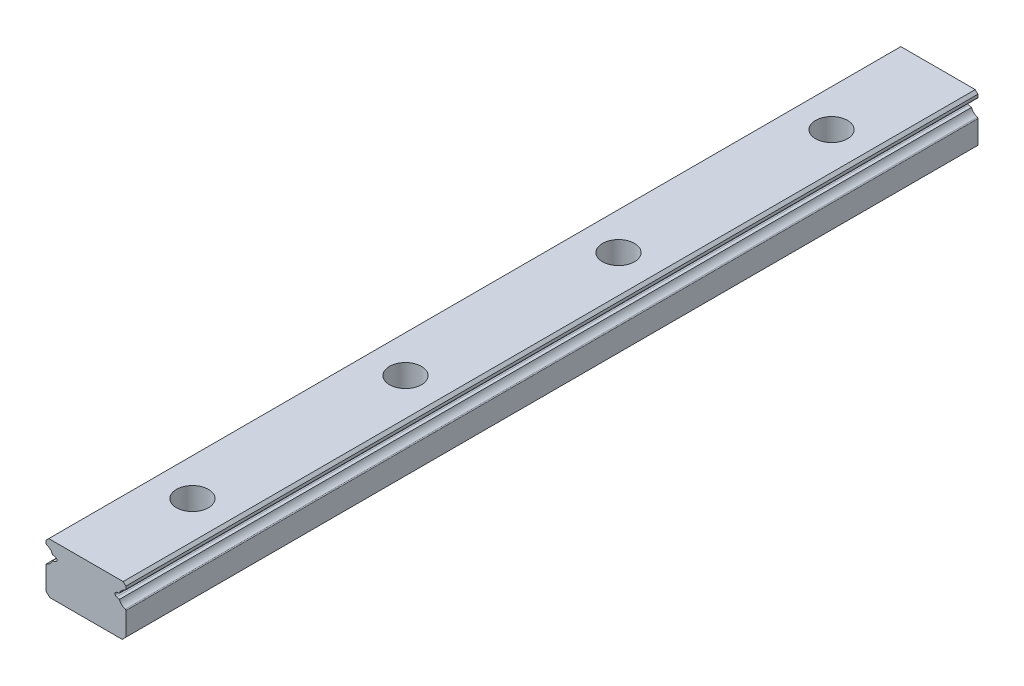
ISO-10303-21;
HEADER;
FILE_DESCRIPTION(('STEP AP214'),'2;1');
FILE_NAME('part.step','',(''),(''),'','','');
FILE_SCHEMA(('AUTOMOTIVE_DESIGN { 1 0 10303 214 1 1 1 1 }'));
ENDSEC;
DATA;
#1=APPLICATION_CONTEXT('core data for automotive mechanical design processes');
#2=APPLICATION_PROTOCOL_DEFINITION('international standard','automotive_design',2000,#1);
#3=PRODUCT_CONTEXT('',#1,'mechanical');
#4=PRODUCT('Part','Part','',(#3));
#5=PRODUCT_RELATED_PRODUCT_CATEGORY('part','',(#4));
#6=PRODUCT_DEFINITION_FORMATION('','',#4);
#7=PRODUCT_DEFINITION_CONTEXT('part definition',#1,'design');
#8=PRODUCT_DEFINITION('design','',#6,#7);
#9=PRODUCT_DEFINITION_SHAPE('','',#8);
#10=(LENGTH_UNIT() NAMED_UNIT(*) SI_UNIT(.MILLI.,.METRE.));
#11=(NAMED_UNIT(*) PLANE_ANGLE_UNIT() SI_UNIT($,.RADIAN.));
#12=(NAMED_UNIT(*) SI_UNIT($,.STERADIAN.) SOLID_ANGLE_UNIT());
#13=UNCERTAINTY_MEASURE_WITH_UNIT(LENGTH_MEASURE(1.E-05),#10,'distance_accuracy_value','');
#14=(GEOMETRIC_REPRESENTATION_CONTEXT(3) GLOBAL_UNCERTAINTY_ASSIGNED_CONTEXT((#13)) GLOBAL_UNIT_ASSIGNED_CONTEXT((#10,
#11,#12)) REPRESENTATION_CONTEXT('',''));
#15=CARTESIAN_POINT('',(0.,0.,0.));
#16=DIRECTION('',(0.,0.,1.));
#17=DIRECTION('',(1.,0.,0.));
#18=AXIS2_PLACEMENT_3D('',#15,#16,#17);
#19=CARTESIAN_POINT('',(-6.27999999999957,-8.749,-160.));
#20=DIRECTION('',(-0.209659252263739,-0.977774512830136,0.));
#21=DIRECTION('',(0.977774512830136,-0.209659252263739,0.));
#22=AXIS2_PLACEMENT_3D('',#19,#20,#21);
#23=PLANE('',#22);
#24=DIRECTION('',(0.977774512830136,-0.209659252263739,0.));
#25=VECTOR('',#24,1.);
#26=CARTESIAN_POINT('',(-6.27999999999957,-8.749,-160.));
#27=LINE('',#26,#25);
#28=CARTESIAN_POINT('',(-6.27999999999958,-8.749,-160.));
#29=VERTEX_POINT('',#28);
#30=CARTESIAN_POINT('',(-5.76751090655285,-8.85889044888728,-160.));
#31=VERTEX_POINT('',#30);
#32=EDGE_CURVE('E211',#29,#31,#27,.T.);
#33=ORIENTED_EDGE('',*,*,#32,.T.);
#34=DIRECTION('',(0.,0.,-1.));
#35=VECTOR('',#34,1.);
#36=CARTESIAN_POINT('',(-5.76751053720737,-8.85889052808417,-160.));
#37=LINE('',#36,#35);
#38=CARTESIAN_POINT('',(-5.76751090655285,-8.85889044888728,0.));
#39=VERTEX_POINT('',#38);
#40=EDGE_CURVE('E182',#31,#39,#37,.F.);
#41=ORIENTED_EDGE('',*,*,#40,.T.);
#42=DIRECTION('',(0.977774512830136,-0.209659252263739,0.));
#43=VECTOR('',#42,1.);
#44=CARTESIAN_POINT('',(-6.27999999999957,-8.749,0.));
#45=LINE('',#44,#43);
#46=CARTESIAN_POINT('',(-6.27999999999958,-8.749,0.));
#47=VERTEX_POINT('',#46);
#48=EDGE_CURVE('E219',#39,#47,#45,.F.);
#49=ORIENTED_EDGE('',*,*,#48,.T.);
#50=DIRECTION('',(0.,0.,-1.));
#51=VECTOR('',#50,1.);
#52=CARTESIAN_POINT('',(-6.27999999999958,-8.749,-160.));
#53=LINE('',#52,#51);
#54=EDGE_CURVE('E214',#47,#29,#53,.T.);
#55=ORIENTED_EDGE('',*,*,#54,.T.);
#56=EDGE_LOOP('',(#33,#41,#49,#55));
#57=FACE_BOUND('',#56,.T.);
#58=ADVANCED_FACE('F16',(#57),#23,.T.);
#59=CARTESIAN_POINT('',(5.7675105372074,-8.85889052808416,-160.));
#60=DIRECTION('',(0.20965925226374,-0.977774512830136,0.));
#61=DIRECTION('',(0.977774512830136,0.20965925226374,0.));
#62=AXIS2_PLACEMENT_3D('',#59,#60,#61);
#63=PLANE('',#62);
#64=DIRECTION('',(0.977774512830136,0.20965925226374,0.));
#65=VECTOR('',#64,1.);
#66=CARTESIAN_POINT('',(5.7675105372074,-8.85889052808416,-160.));
#67=LINE('',#66,#65);
#68=CARTESIAN_POINT('',(5.76751090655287,-8.85889044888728,-160.));
#69=VERTEX_POINT('',#68);
#70=CARTESIAN_POINT('',(6.27999999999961,-8.749,-160.));
#71=VERTEX_POINT('',#70);
#72=EDGE_CURVE('E184',#69,#71,#67,.T.);
#73=ORIENTED_EDGE('',*,*,#72,.T.);
#74=DIRECTION('',(0.,0.,-1.));
#75=VECTOR('',#74,1.);
#76=CARTESIAN_POINT('',(6.27999999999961,-8.749,-160.));
#77=LINE('',#76,#75);
#78=CARTESIAN_POINT('',(6.27999999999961,-8.749,0.));
#79=VERTEX_POINT('',#78);
#80=EDGE_CURVE('E222',#71,#79,#77,.F.);
#81=ORIENTED_EDGE('',*,*,#80,.T.);
#82=DIRECTION('',(0.977774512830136,0.20965925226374,0.));
#83=VECTOR('',#82,1.);
#84=CARTESIAN_POINT('',(5.7675105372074,-8.85889052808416,0.));
#85=LINE('',#84,#83);
#86=CARTESIAN_POINT('',(5.76751090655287,-8.85889044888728,0.));
#87=VERTEX_POINT('',#86);
#88=EDGE_CURVE('E209',#79,#87,#85,.F.);
#89=ORIENTED_EDGE('',*,*,#88,.T.);
#90=DIRECTION('',(0.,0.,-1.));
#91=VECTOR('',#90,1.);
#92=CARTESIAN_POINT('',(5.7675105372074,-8.85889052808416,-160.));
#93=LINE('',#92,#91);
#94=EDGE_CURVE('E204',#87,#69,#93,.T.);
#95=ORIENTED_EDGE('',*,*,#94,.T.);
#96=EDGE_LOOP('',(#73,#81,#89,#95));
#97=FACE_BOUND('',#96,.T.);
#98=ADVANCED_FACE('F834',(#97),#63,.T.);
#99=CARTESIAN_POINT('',(-5.85137497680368,-9.25000017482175,-160.));
#100=DIRECTION('',(0.,0.,-1.));
#101=DIRECTION('',(-1.,0.,0.));
#102=AXIS2_PLACEMENT_3D('',#99,#100,#101);
#103=CYLINDRICAL_SURFACE('',#102,0.4);
#104=ORIENTED_EDGE('',*,*,#40,.F.);
#105=CARTESIAN_POINT('',(-5.85137497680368,-9.25000017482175,-160.));
#106=DIRECTION('',(0.,0.,-1.));
#107=DIRECTION('',(-1.,0.,0.));
#108=AXIS2_PLACEMENT_3D('',#105,#106,#107);
#109=CIRCLE('',#108,0.4);
#110=CARTESIAN_POINT('',(-5.767,-9.641,-160.));
#111=VERTEX_POINT('',#110);
#112=EDGE_CURVE('E19',#111,#31,#109,.F.);
#113=ORIENTED_EDGE('',*,*,#112,.F.);
#114=DIRECTION('',(0.,0.,1.));
#115=VECTOR('',#114,1.);
#116=CARTESIAN_POINT('',(-5.767,-9.641,-160.));
#117=LINE('',#116,#115);
#118=CARTESIAN_POINT('',(-5.767,-9.641,0.));
#119=VERTEX_POINT('',#118);
#120=EDGE_CURVE('E179',#119,#111,#117,.F.);
#121=ORIENTED_EDGE('',*,*,#120,.F.);
#122=CARTESIAN_POINT('',(-5.85137497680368,-9.25000017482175,0.));
#123=DIRECTION('',(0.,0.,-1.));
#124=DIRECTION('',(-1.,0.,0.));
#125=AXIS2_PLACEMENT_3D('',#122,#123,#124);
#126=CIRCLE('',#125,0.4);
#127=EDGE_CURVE('E226',#39,#119,#126,.T.);
#128=ORIENTED_EDGE('',*,*,#127,.F.);
#129=EDGE_LOOP('',(#104,#113,#121,#128));
#130=FACE_BOUND('',#129,.T.);
#131=ADVANCED_FACE('F176',(#130),#103,.F.);
#132=CARTESIAN_POINT('',(7.89004225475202,-9.33975285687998,-160.));
#133=DIRECTION('',(0.,0.,-1.));
#134=DIRECTION('',(-1.,0.,0.));
#135=AXIS2_PLACEMENT_3D('',#132,#133,#134);
#136=CYLINDRICAL_SURFACE('',#135,1.715);
#137=ORIENTED_EDGE('',*,*,#80,.F.);
#138=CARTESIAN_POINT('',(7.89004225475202,-9.33975285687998,-160.));
#139=DIRECTION('',(0.,0.,-1.));
#140=DIRECTION('',(-1.,0.,0.));
#141=AXIS2_PLACEMENT_3D('',#138,#139,#140);
#142=CIRCLE('',#141,1.715);
#143=CARTESIAN_POINT('',(7.35000000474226,-7.71199999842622,-160.));
#144=VERTEX_POINT('',#143);
#145=EDGE_CURVE('E225',#144,#71,#142,.F.);
#146=ORIENTED_EDGE('',*,*,#145,.F.);
#147=DIRECTION('',(0.,0.,-1.));
#148=VECTOR('',#147,1.);
#149=CARTESIAN_POINT('',(7.35000000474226,-7.71199999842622,-160.));
#150=LINE('',#149,#148);
#151=CARTESIAN_POINT('',(7.35000000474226,-7.71199999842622,0.));
#152=VERTEX_POINT('',#151);
#153=EDGE_CURVE('E202',#152,#144,#150,.T.);
#154=ORIENTED_EDGE('',*,*,#153,.F.);
#155=CARTESIAN_POINT('',(7.89004225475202,-9.33975285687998,0.));
#156=DIRECTION('',(0.,0.,-1.));
#157=DIRECTION('',(-1.,0.,0.));
#158=AXIS2_PLACEMENT_3D('',#155,#156,#157);
#159=CIRCLE('',#158,1.715);
#160=EDGE_CURVE('E218',#79,#152,#159,.T.);
#161=ORIENTED_EDGE('',*,*,#160,.F.);
#162=EDGE_LOOP('',(#137,#146,#154,#161));
#163=FACE_BOUND('',#162,.T.);
#164=ADVANCED_FACE('F818',(#163),#136,.F.);
#165=CARTESIAN_POINT('',(-7.890042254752,-9.33975285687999,-160.));
#166=DIRECTION('',(0.,0.,-1.));
#167=DIRECTION('',(-1.,0.,0.));
#168=AXIS2_PLACEMENT_3D('',#165,#166,#167);
#169=CYLINDRICAL_SURFACE('',#168,1.715);
#170=DIRECTION('',(0.,0.,-1.));
#171=VECTOR('',#170,1.);
#172=CARTESIAN_POINT('',(-7.34999999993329,-7.7120000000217,-160.));
#173=LINE('',#172,#171);
#174=CARTESIAN_POINT('',(-7.34999999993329,-7.71200000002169,-160.));
#175=VERTEX_POINT('',#174);
#176=CARTESIAN_POINT('',(-7.34999999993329,-7.7120000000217,0.));
#177=VERTEX_POINT('',#176);
#178=EDGE_CURVE('E309',#175,#177,#173,.F.);
#179=ORIENTED_EDGE('',*,*,#178,.F.);
#180=CARTESIAN_POINT('',(-7.890042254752,-9.33975285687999,-160.));
#181=DIRECTION('',(0.,0.,-1.));
#182=DIRECTION('',(-1.,0.,0.));
#183=AXIS2_PLACEMENT_3D('',#180,#181,#182);
#184=CIRCLE('',#183,1.715);
#185=EDGE_CURVE('E217',#29,#175,#184,.F.);
#186=ORIENTED_EDGE('',*,*,#185,.F.);
#187=ORIENTED_EDGE('',*,*,#54,.F.);
#188=CARTESIAN_POINT('',(-7.890042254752,-9.33975285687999,0.));
#189=DIRECTION('',(0.,0.,-1.));
#190=DIRECTION('',(-1.,0.,0.));
#191=AXIS2_PLACEMENT_3D('',#188,#189,#190);
#192=CIRCLE('',#191,1.715);
#193=EDGE_CURVE('E208',#177,#47,#192,.T.);
#194=ORIENTED_EDGE('',*,*,#193,.F.);
#195=EDGE_LOOP('',(#179,#186,#187,#194));
#196=FACE_BOUND('',#195,.T.);
#197=ADVANCED_FACE('F334',(#196),#169,.F.);
#198=CARTESIAN_POINT('',(5.85137497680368,-9.25000017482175,-160.));
#199=DIRECTION('',(0.,0.,-1.));
#200=DIRECTION('',(-1.,0.,0.));
#201=AXIS2_PLACEMENT_3D('',#198,#199,#200);
#202=CYLINDRICAL_SURFACE('',#201,0.4);
#203=DIRECTION('',(0.,0.,1.));
#204=VECTOR('',#203,1.);
#205=CARTESIAN_POINT('',(5.767,-9.641,-160.));
#206=LINE('',#205,#204);
#207=CARTESIAN_POINT('',(5.767,-9.641,-160.));
#208=VERTEX_POINT('',#207);
#209=CARTESIAN_POINT('',(5.767,-9.641,0.));
#210=VERTEX_POINT('',#209);
#211=EDGE_CURVE('E305',#208,#210,#206,.T.);
#212=ORIENTED_EDGE('',*,*,#211,.F.);
#213=CARTESIAN_POINT('',(5.85137497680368,-9.25000017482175,-160.));
#214=DIRECTION('',(0.,0.,-1.));
#215=DIRECTION('',(-1.,0.,0.));
#216=AXIS2_PLACEMENT_3D('',#213,#214,#215);
#217=CIRCLE('',#216,0.4);
#218=EDGE_CURVE('E207',#69,#208,#217,.F.);
#219=ORIENTED_EDGE('',*,*,#218,.F.);
#220=ORIENTED_EDGE('',*,*,#94,.F.);
#221=CARTESIAN_POINT('',(5.85137497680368,-9.25000017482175,0.));
#222=DIRECTION('',(0.,0.,-1.));
#223=DIRECTION('',(-1.,0.,0.));
#224=AXIS2_PLACEMENT_3D('',#221,#222,#223);
#225=CIRCLE('',#224,0.4);
#226=EDGE_CURVE('E198',#210,#87,#225,.T.);
#227=ORIENTED_EDGE('',*,*,#226,.F.);
#228=EDGE_LOOP('',(#212,#219,#220,#227));
#229=FACE_BOUND('',#228,.T.);
#230=ADVANCED_FACE('F802',(#229),#202,.F.);
#231=CARTESIAN_POINT('',(-5.767,-9.641,-160.));
#232=DIRECTION('',(-0.207835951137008,0.978163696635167,0.));
#233=DIRECTION('',(-0.978163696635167,-0.207835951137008,0.));
#234=AXIS2_PLACEMENT_3D('',#231,#232,#233);
#235=PLANE('',#234);
#236=DIRECTION('',(-0.978163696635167,-0.207835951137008,0.));
#237=VECTOR('',#236,1.);
#238=CARTESIAN_POINT('',(-5.767,-9.641,-160.));
#239=LINE('',#238,#237);
#240=CARTESIAN_POINT('',(-6.28,-9.75,-160.));
#241=VERTEX_POINT('',#240);
#242=EDGE_CURVE('E186',#111,#241,#239,.T.);
#243=ORIENTED_EDGE('',*,*,#242,.T.);
#244=DIRECTION('',(0.,0.,-1.));
#245=VECTOR('',#244,1.);
#246=CARTESIAN_POINT('',(-6.28,-9.75,-160.));
#247=LINE('',#246,#245);
#248=CARTESIAN_POINT('',(-6.28,-9.75,0.));
#249=VERTEX_POINT('',#248);
#250=EDGE_CURVE('E303',#241,#249,#247,.F.);
#251=ORIENTED_EDGE('',*,*,#250,.T.);
#252=DIRECTION('',(-0.978163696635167,-0.207835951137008,0.));
#253=VECTOR('',#252,1.);
#254=CARTESIAN_POINT('',(-5.767,-9.641,0.));
#255=LINE('',#254,#253);
#256=EDGE_CURVE('E196',#249,#119,#255,.F.);
#257=ORIENTED_EDGE('',*,*,#256,.T.);
#258=ORIENTED_EDGE('',*,*,#120,.T.);
#259=EDGE_LOOP('',(#243,#251,#257,#258));
#260=FACE_BOUND('',#259,.T.);
#261=ADVANCED_FACE('F195',(#260),#235,.T.);
#262=CARTESIAN_POINT('',(7.287,-7.52218166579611,-160.));
#263=DIRECTION('',(0.,0.,-1.));
#264=DIRECTION('',(-1.,0.,0.));
#265=AXIS2_PLACEMENT_3D('',#262,#263,#264);
#266=CYLINDRICAL_SURFACE('',#265,0.2);
#267=CARTESIAN_POINT('',(7.287,-7.52218166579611,-160.));
#268=DIRECTION('',(0.,0.,-1.));
#269=DIRECTION('',(-1.,0.,0.));
#270=AXIS2_PLACEMENT_3D('',#267,#268,#269);
#271=CIRCLE('',#270,0.2);
#272=CARTESIAN_POINT('',(7.487,-7.52218165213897,-160.));
#273=VERTEX_POINT('',#272);
#274=EDGE_CURVE('E313',#144,#273,#271,.F.);
#275=ORIENTED_EDGE('',*,*,#274,.T.);
#276=DIRECTION('',(0.,0.,-1.));
#277=VECTOR('',#276,1.);
#278=CARTESIAN_POINT('',(7.487,-7.52218163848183,-160.));
#279=LINE('',#278,#277);
#280=CARTESIAN_POINT('',(7.487,-7.52218165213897,0.));
#281=VERTEX_POINT('',#280);
#282=EDGE_CURVE('E371',#281,#273,#279,.T.);
#283=ORIENTED_EDGE('',*,*,#282,.F.);
#284=CARTESIAN_POINT('',(7.287,-7.52218166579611,0.));
#285=DIRECTION('',(0.,0.,-1.));
#286=DIRECTION('',(-1.,0.,0.));
#287=AXIS2_PLACEMENT_3D('',#284,#285,#286);
#288=CIRCLE('',#287,0.2);
#289=EDGE_CURVE('E193',#281,#152,#288,.T.);
#290=ORIENTED_EDGE('',*,*,#289,.T.);
#291=ORIENTED_EDGE('',*,*,#153,.T.);
#292=EDGE_LOOP('',(#275,#283,#290,#291));
#293=FACE_BOUND('',#292,.T.);
#294=ADVANCED_FACE('F787',(#293),#266,.T.);
#295=CARTESIAN_POINT('',(-7.288,-7.52185268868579,-160.));
#296=DIRECTION('',(0.,0.,-1.));
#297=DIRECTION('',(-1.,0.,0.));
#298=AXIS2_PLACEMENT_3D('',#295,#296,#297);
#299=CYLINDRICAL_SURFACE('',#298,0.200000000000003);
#300=CARTESIAN_POINT('',(-7.288,-7.52185268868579,-160.));
#301=DIRECTION('',(0.,0.,-1.));
#302=DIRECTION('',(-1.,0.,0.));
#303=AXIS2_PLACEMENT_3D('',#300,#301,#302);
#304=CIRCLE('',#303,0.200000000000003);
#305=CARTESIAN_POINT('',(-7.488,-7.52185267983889,-160.));
#306=VERTEX_POINT('',#305);
#307=EDGE_CURVE('E306',#306,#175,#304,.F.);
#308=ORIENTED_EDGE('',*,*,#307,.T.);
#309=ORIENTED_EDGE('',*,*,#178,.T.);
#310=CARTESIAN_POINT('',(-7.288,-7.52185268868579,0.));
#311=DIRECTION('',(0.,0.,-1.));
#312=DIRECTION('',(-1.,0.,0.));
#313=AXIS2_PLACEMENT_3D('',#310,#311,#312);
#314=CIRCLE('',#313,0.200000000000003);
#315=CARTESIAN_POINT('',(-7.488,-7.52185267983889,0.));
#316=VERTEX_POINT('',#315);
#317=EDGE_CURVE('E310',#177,#316,#314,.T.);
#318=ORIENTED_EDGE('',*,*,#317,.T.);
#319=DIRECTION('',(0.,0.,1.));
#320=VECTOR('',#319,1.);
#321=CARTESIAN_POINT('',(-7.488,-7.52185267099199,-160.));
#322=LINE('',#321,#320);
#323=EDGE_CURVE('E339',#306,#316,#322,.T.);
#324=ORIENTED_EDGE('',*,*,#323,.F.);
#325=EDGE_LOOP('',(#308,#309,#318,#324));
#326=FACE_BOUND('',#325,.T.);
#327=ADVANCED_FACE('F337',(#326),#299,.T.);
#328=CARTESIAN_POINT('',(6.28,-9.75,-160.));
#329=DIRECTION('',(0.207835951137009,0.978163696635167,0.));
#330=DIRECTION('',(-0.978163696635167,0.207835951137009,0.));
#331=AXIS2_PLACEMENT_3D('',#328,#329,#330);
#332=PLANE('',#331);
#333=DIRECTION('',(-0.978163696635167,0.207835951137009,0.));
#334=VECTOR('',#333,1.);
#335=CARTESIAN_POINT('',(6.28,-9.75,-160.));
#336=LINE('',#335,#334);
#337=CARTESIAN_POINT('',(6.28,-9.75,-160.));
#338=VERTEX_POINT('',#337);
#339=EDGE_CURVE('E395',#338,#208,#336,.T.);
#340=ORIENTED_EDGE('',*,*,#339,.T.);
#341=ORIENTED_EDGE('',*,*,#211,.T.);
#342=DIRECTION('',(-0.978163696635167,0.207835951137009,0.));
#343=VECTOR('',#342,1.);
#344=CARTESIAN_POINT('',(6.28,-9.75,0.));
#345=LINE('',#344,#343);
#346=CARTESIAN_POINT('',(6.28,-9.75,0.));
#347=VERTEX_POINT('',#346);
#348=EDGE_CURVE('E336',#210,#347,#345,.F.);
#349=ORIENTED_EDGE('',*,*,#348,.T.);
#350=DIRECTION('',(0.,0.,-1.));
#351=VECTOR('',#350,1.);
#352=CARTESIAN_POINT('',(6.28,-9.75,-160.));
#353=LINE('',#352,#351);
#354=EDGE_CURVE('E299',#347,#338,#353,.T.);
#355=ORIENTED_EDGE('',*,*,#354,.T.);
#356=EDGE_LOOP('',(#340,#341,#349,#355));
#357=FACE_BOUND('',#356,.T.);
#358=ADVANCED_FACE('F502',(#357),#332,.T.);
#359=CARTESIAN_POINT('',(-7.89007044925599,-9.159323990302,-160.));
#360=DIRECTION('',(0.,0.,-1.));
#361=DIRECTION('',(-1.,0.,0.));
#362=AXIS2_PLACEMENT_3D('',#359,#360,#361);
#363=CYLINDRICAL_SURFACE('',#362,1.715);
#364=ORIENTED_EDGE('',*,*,#250,.F.);
#365=CARTESIAN_POINT('',(-7.89007044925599,-9.159323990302,-160.));
#366=DIRECTION('',(0.,0.,-1.));
#367=DIRECTION('',(-1.,0.,0.));
#368=AXIS2_PLACEMENT_3D('',#365,#366,#367);
#369=CIRCLE('',#368,1.715);
#370=CARTESIAN_POINT('',(-7.36199999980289,-10.7909999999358,-160.));
#371=VERTEX_POINT('',#370);
#372=EDGE_CURVE('E189',#371,#241,#369,.F.);
#373=ORIENTED_EDGE('',*,*,#372,.F.);
#374=DIRECTION('',(0.,0.,-1.));
#375=VECTOR('',#374,1.);
#376=CARTESIAN_POINT('',(-7.36199999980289,-10.7909999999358,-160.));
#377=LINE('',#376,#375);
#378=CARTESIAN_POINT('',(-7.36199999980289,-10.7909999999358,0.));
#379=VERTEX_POINT('',#378);
#380=EDGE_CURVE('E290',#379,#371,#377,.T.);
#381=ORIENTED_EDGE('',*,*,#380,.F.);
#382=CARTESIAN_POINT('',(-7.89007044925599,-9.159323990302,0.));
#383=DIRECTION('',(0.,0.,-1.));
#384=DIRECTION('',(-1.,0.,0.));
#385=AXIS2_PLACEMENT_3D('',#382,#383,#384);
#386=CIRCLE('',#385,1.715);
#387=EDGE_CURVE('E300',#249,#379,#386,.T.);
#388=ORIENTED_EDGE('',*,*,#387,.F.);
#389=EDGE_LOOP('',(#364,#373,#381,#388));
#390=FACE_BOUND('',#389,.T.);
#391=ADVANCED_FACE('F499',(#390),#363,.F.);
#392=CARTESIAN_POINT('',(7.487,-7.52218163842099,-160.));
#393=DIRECTION('',(1.,0.,0.));
#394=DIRECTION('',(0.,0.,-1.));
#395=AXIS2_PLACEMENT_3D('',#392,#393,#394);
#396=PLANE('',#395);
#397=DIRECTION('',(0.,1.,0.));
#398=VECTOR('',#397,1.);
#399=CARTESIAN_POINT('',(7.487,-7.52218163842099,-160.));
#400=LINE('',#399,#398);
#401=CARTESIAN_POINT('',(7.487,-7.,-160.));
#402=VERTEX_POINT('',#401);
#403=EDGE_CURVE('E351',#273,#402,#400,.T.);
#404=ORIENTED_EDGE('',*,*,#403,.T.);
#405=DIRECTION('',(0.,0.,1.));
#406=VECTOR('',#405,1.);
#407=CARTESIAN_POINT('',(7.487,-7.,-160.));
#408=LINE('',#407,#406);
#409=CARTESIAN_POINT('',(7.487,-7.,0.));
#410=VERTEX_POINT('',#409);
#411=EDGE_CURVE('E378',#410,#402,#408,.F.);
#412=ORIENTED_EDGE('',*,*,#411,.F.);
#413=DIRECTION('',(0.,1.,0.));
#414=VECTOR('',#413,1.);
#415=CARTESIAN_POINT('',(7.487,-7.52218163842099,0.));
#416=LINE('',#415,#414);
#417=EDGE_CURVE('E302',#410,#281,#416,.F.);
#418=ORIENTED_EDGE('',*,*,#417,.T.);
#419=ORIENTED_EDGE('',*,*,#282,.T.);
#420=EDGE_LOOP('',(#404,#412,#418,#419));
#421=FACE_BOUND('',#420,.T.);
#422=ADVANCED_FACE('F501',(#421),#396,.T.);
#423=CARTESIAN_POINT('',(-7.488,-7.,-160.));
#424=DIRECTION('',(-1.,0.,0.));
#425=DIRECTION('',(0.,0.,1.));
#426=AXIS2_PLACEMENT_3D('',#423,#424,#425);
#427=PLANE('',#426);
#428=DIRECTION('',(0.,1.,0.));
#429=VECTOR('',#428,1.);
#430=CARTESIAN_POINT('',(-7.488,-7.,-160.));
#431=LINE('',#430,#429);
#432=CARTESIAN_POINT('',(-7.488,-7.,-160.));
#433=VERTEX_POINT('',#432);
#434=EDGE_CURVE('E343',#433,#306,#431,.F.);
#435=ORIENTED_EDGE('',*,*,#434,.T.);
#436=ORIENTED_EDGE('',*,*,#323,.T.);
#437=DIRECTION('',(0.,1.,0.));
#438=VECTOR('',#437,1.);
#439=CARTESIAN_POINT('',(-7.488,-7.,0.));
#440=LINE('',#439,#438);
#441=CARTESIAN_POINT('',(-7.488,-7.,0.));
#442=VERTEX_POINT('',#441);
#443=EDGE_CURVE('E349',#316,#442,#440,.T.);
#444=ORIENTED_EDGE('',*,*,#443,.T.);
#445=DIRECTION('',(0.,0.,1.));
#446=VECTOR('',#445,1.);
#447=CARTESIAN_POINT('',(-7.488,-7.,-160.));
#448=LINE('',#447,#446);
#449=EDGE_CURVE('E286',#433,#442,#448,.T.);
#450=ORIENTED_EDGE('',*,*,#449,.F.);
#451=EDGE_LOOP('',(#435,#436,#444,#450));
#452=FACE_BOUND('',#451,.T.);
#453=ADVANCED_FACE('F346',(#452),#427,.T.);
#454=CARTESIAN_POINT('',(7.890070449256,-9.159323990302,-160.));
#455=DIRECTION('',(0.,0.,-1.));
#456=DIRECTION('',(-1.,0.,0.));
#457=AXIS2_PLACEMENT_3D('',#454,#455,#456);
#458=CYLINDRICAL_SURFACE('',#457,1.715);
#459=DIRECTION('',(0.,0.,-1.));
#460=VECTOR('',#459,1.);
#461=CARTESIAN_POINT('',(7.36199999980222,-10.7909999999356,-160.));
#462=LINE('',#461,#460);
#463=CARTESIAN_POINT('',(7.36199999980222,-10.7909999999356,-160.));
#464=VERTEX_POINT('',#463);
#465=CARTESIAN_POINT('',(7.36199999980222,-10.7909999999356,0.));
#466=VERTEX_POINT('',#465);
#467=EDGE_CURVE('E280',#464,#466,#462,.F.);
#468=ORIENTED_EDGE('',*,*,#467,.F.);
#469=CARTESIAN_POINT('',(7.890070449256,-9.159323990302,-160.));
#470=DIRECTION('',(0.,0.,-1.));
#471=DIRECTION('',(-1.,0.,0.));
#472=AXIS2_PLACEMENT_3D('',#469,#470,#471);
#473=CIRCLE('',#472,1.715);
#474=EDGE_CURVE('E297',#338,#464,#473,.F.);
#475=ORIENTED_EDGE('',*,*,#474,.F.);
#476=ORIENTED_EDGE('',*,*,#354,.F.);
#477=CARTESIAN_POINT('',(7.890070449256,-9.159323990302,0.));
#478=DIRECTION('',(0.,0.,-1.));
#479=DIRECTION('',(-1.,0.,0.));
#480=AXIS2_PLACEMENT_3D('',#477,#478,#479);
#481=CIRCLE('',#480,1.715);
#482=EDGE_CURVE('E294',#466,#347,#481,.T.);
#483=ORIENTED_EDGE('',*,*,#482,.F.);
#484=EDGE_LOOP('',(#468,#475,#476,#483));
#485=FACE_BOUND('',#484,.T.);
#486=ADVANCED_FACE('F601',(#485),#458,.F.);
#487=CARTESIAN_POINT('',(-7.3,-10.9811473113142,-160.));
#488=DIRECTION('',(0.,0.,-1.));
#489=DIRECTION('',(-1.,0.,0.));
#490=AXIS2_PLACEMENT_3D('',#487,#488,#489);
#491=CYLINDRICAL_SURFACE('',#490,0.200000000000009);
#492=CARTESIAN_POINT('',(-7.3,-10.9811473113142,-160.));
#493=DIRECTION('',(0.,0.,-1.));
#494=DIRECTION('',(-1.,0.,0.));
#495=AXIS2_PLACEMENT_3D('',#492,#493,#494);
#496=CIRCLE('',#495,0.200000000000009);
#497=CARTESIAN_POINT('',(-7.5,-10.9811473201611,-160.));
#498=VERTEX_POINT('',#497);
#499=EDGE_CURVE('E287',#371,#498,#496,.F.);
#500=ORIENTED_EDGE('',*,*,#499,.T.);
#501=DIRECTION('',(0.,0.,1.));
#502=VECTOR('',#501,1.);
#503=CARTESIAN_POINT('',(-7.5,-10.981147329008,-160.));
#504=LINE('',#503,#502);
#505=CARTESIAN_POINT('',(-7.5,-10.9811473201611,0.));
#506=VERTEX_POINT('',#505);
#507=EDGE_CURVE('E273',#506,#498,#504,.F.);
#508=ORIENTED_EDGE('',*,*,#507,.F.);
#509=CARTESIAN_POINT('',(-7.3,-10.9811473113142,0.));
#510=DIRECTION('',(0.,0.,-1.));
#511=DIRECTION('',(-1.,0.,0.));
#512=AXIS2_PLACEMENT_3D('',#509,#510,#511);
#513=CIRCLE('',#512,0.200000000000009);
#514=EDGE_CURVE('E291',#506,#379,#513,.T.);
#515=ORIENTED_EDGE('',*,*,#514,.T.);
#516=ORIENTED_EDGE('',*,*,#380,.T.);
#517=EDGE_LOOP('',(#500,#508,#515,#516));
#518=FACE_BOUND('',#517,.T.);
#519=ADVANCED_FACE('F495',(#518),#491,.T.);
#520=CARTESIAN_POINT('',(0.,-16.,-100.));
#521=DIRECTION('',(0.,1.,0.));
#522=DIRECTION('',(0.,0.,1.));
#523=AXIS2_PLACEMENT_3D('',#520,#521,#522);
#524=CYLINDRICAL_SURFACE('',#523,3.);
#525=CARTESIAN_POINT('',(0.,-6.5,-100.));
#526=DIRECTION('',(0.,1.,0.));
#527=DIRECTION('',(0.,0.,1.));
#528=AXIS2_PLACEMENT_3D('',#525,#526,#527);
#529=CIRCLE('',#528,3.);
#530=CARTESIAN_POINT('',(0.,-6.5,-97.));
#531=VERTEX_POINT('',#530);
#532=EDGE_CURVE('E270',#531,#531,#529,.F.);
#533=ORIENTED_EDGE('',*,*,#532,.F.);
#534=EDGE_LOOP('',(#533));
#535=FACE_BOUND('',#534,.T.);
#536=CARTESIAN_POINT('',(0.,-11.,-100.));
#537=DIRECTION('',(0.,1.,0.));
#538=DIRECTION('',(0.,0.,1.));
#539=AXIS2_PLACEMENT_3D('',#536,#537,#538);
#540=CIRCLE('',#539,3.);
#541=CARTESIAN_POINT('',(0.,-11.,-97.));
#542=VERTEX_POINT('',#541);
#543=EDGE_CURVE('E277',#542,#542,#540,.T.);
#544=ORIENTED_EDGE('',*,*,#543,.F.);
#545=EDGE_LOOP('',(#544));
#546=FACE_BOUND('',#545,.T.);
#547=ADVANCED_FACE('F594',(#535,#546),#524,.F.);
#548=CARTESIAN_POINT('',(0.,-16.,-20.));
#549=DIRECTION('',(0.,1.,0.));
#550=DIRECTION('',(0.,0.,1.));
#551=AXIS2_PLACEMENT_3D('',#548,#549,#550);
#552=CYLINDRICAL_SURFACE('',#551,3.);
#553=CARTESIAN_POINT('',(0.,-6.5,-20.));
#554=DIRECTION('',(0.,1.,0.));
#555=DIRECTION('',(0.,0.,1.));
#556=AXIS2_PLACEMENT_3D('',#553,#554,#555);
#557=CIRCLE('',#556,3.);
#558=CARTESIAN_POINT('',(0.,-6.5,-17.));
#559=VERTEX_POINT('',#558);
#560=EDGE_CURVE('E266',#559,#559,#557,.F.);
#561=ORIENTED_EDGE('',*,*,#560,.F.);
#562=EDGE_LOOP('',(#561));
#563=FACE_BOUND('',#562,.T.);
#564=CARTESIAN_POINT('',(0.,-11.,-20.));
#565=DIRECTION('',(0.,1.,0.));
#566=DIRECTION('',(0.,0.,1.));
#567=AXIS2_PLACEMENT_3D('',#564,#565,#566);
#568=CIRCLE('',#567,3.);
#569=CARTESIAN_POINT('',(0.,-11.,-17.));
#570=VERTEX_POINT('',#569);
#571=EDGE_CURVE('E274',#570,#570,#568,.T.);
#572=ORIENTED_EDGE('',*,*,#571,.F.);
#573=EDGE_LOOP('',(#572));
#574=FACE_BOUND('',#573,.T.);
#575=ADVANCED_FACE('F590',(#563,#574),#552,.F.);
#576=CARTESIAN_POINT('',(7.487,-7.,-160.));
#577=DIRECTION('',(0.707106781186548,0.707106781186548,0.));
#578=DIRECTION('',(-0.707106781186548,0.707106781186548,0.));
#579=AXIS2_PLACEMENT_3D('',#576,#577,#578);
#580=PLANE('',#579);
#581=DIRECTION('',(-0.707106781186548,0.707106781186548,0.));
#582=VECTOR('',#581,1.);
#583=CARTESIAN_POINT('',(7.487,-7.,-160.));
#584=LINE('',#583,#582);
#585=CARTESIAN_POINT('',(6.987,-6.5,-160.));
#586=VERTEX_POINT('',#585);
#587=EDGE_CURVE('E368',#402,#586,#584,.T.);
#588=ORIENTED_EDGE('',*,*,#587,.T.);
#589=DIRECTION('',(0.,0.,1.));
#590=VECTOR('',#589,1.);
#591=CARTESIAN_POINT('',(6.987,-6.5,-160.));
#592=LINE('',#591,#590);
#593=CARTESIAN_POINT('',(6.987,-6.5,0.));
#594=VERTEX_POINT('',#593);
#595=EDGE_CURVE('E269',#594,#586,#592,.F.);
#596=ORIENTED_EDGE('',*,*,#595,.F.);
#597=DIRECTION('',(-0.707106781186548,0.707106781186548,0.));
#598=VECTOR('',#597,1.);
#599=CARTESIAN_POINT('',(7.487,-7.,0.));
#600=LINE('',#599,#598);
#601=EDGE_CURVE('E289',#594,#410,#600,.F.);
#602=ORIENTED_EDGE('',*,*,#601,.T.);
#603=ORIENTED_EDGE('',*,*,#411,.T.);
#604=EDGE_LOOP('',(#588,#596,#602,#603));
#605=FACE_BOUND('',#604,.T.);
#606=ADVANCED_FACE('F586',(#605),#580,.T.);
#607=CARTESIAN_POINT('',(-6.988,-6.5,-160.));
#608=DIRECTION('',(-0.707106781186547,0.707106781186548,0.));
#609=DIRECTION('',(-0.707106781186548,-0.707106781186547,0.));
#610=AXIS2_PLACEMENT_3D('',#607,#608,#609);
#611=PLANE('',#610);
#612=DIRECTION('',(-0.707106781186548,-0.707106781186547,0.));
#613=VECTOR('',#612,1.);
#614=CARTESIAN_POINT('',(-6.988,-6.5,-160.));
#615=LINE('',#614,#613);
#616=CARTESIAN_POINT('',(-6.988,-6.5,-160.));
#617=VERTEX_POINT('',#616);
#618=EDGE_CURVE('E358',#617,#433,#615,.T.);
#619=ORIENTED_EDGE('',*,*,#618,.T.);
#620=ORIENTED_EDGE('',*,*,#449,.T.);
#621=DIRECTION('',(-0.707106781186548,-0.707106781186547,0.));
#622=VECTOR('',#621,1.);
#623=CARTESIAN_POINT('',(-6.988,-6.5,0.));
#624=LINE('',#623,#622);
#625=CARTESIAN_POINT('',(-6.988,-6.5,0.));
#626=VERTEX_POINT('',#625);
#627=EDGE_CURVE('E362',#442,#626,#624,.F.);
#628=ORIENTED_EDGE('',*,*,#627,.T.);
#629=DIRECTION('',(0.,0.,1.));
#630=VECTOR('',#629,1.);
#631=CARTESIAN_POINT('',(-6.988,-6.5,-160.));
#632=LINE('',#631,#630);
#633=EDGE_CURVE('E265',#617,#626,#632,.T.);
#634=ORIENTED_EDGE('',*,*,#633,.F.);
#635=EDGE_LOOP('',(#619,#620,#628,#634));
#636=FACE_BOUND('',#635,.T.);
#637=ADVANCED_FACE('F582',(#636),#611,.T.);
#638=CARTESIAN_POINT('',(7.3,-10.9811473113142,-160.));
#639=DIRECTION('',(0.,0.,-1.));
#640=DIRECTION('',(-1.,0.,0.));
#641=AXIS2_PLACEMENT_3D('',#638,#639,#640);
#642=CYLINDRICAL_SURFACE('',#641,0.2);
#643=CARTESIAN_POINT('',(7.3,-10.9811473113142,-160.));
#644=DIRECTION('',(0.,0.,-1.));
#645=DIRECTION('',(-1.,0.,0.));
#646=AXIS2_PLACEMENT_3D('',#643,#644,#645);
#647=CIRCLE('',#646,0.2);
#648=CARTESIAN_POINT('',(7.5,-10.9811473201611,-160.));
#649=VERTEX_POINT('',#648);
#650=EDGE_CURVE('E281',#649,#464,#647,.F.);
#651=ORIENTED_EDGE('',*,*,#650,.T.);
#652=ORIENTED_EDGE('',*,*,#467,.T.);
#653=CARTESIAN_POINT('',(7.3,-10.9811473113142,0.));
#654=DIRECTION('',(0.,0.,-1.));
#655=DIRECTION('',(-1.,0.,0.));
#656=AXIS2_PLACEMENT_3D('',#653,#654,#655);
#657=CIRCLE('',#656,0.2);
#658=CARTESIAN_POINT('',(7.5,-10.9811473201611,0.));
#659=VERTEX_POINT('',#658);
#660=EDGE_CURVE('E284',#466,#659,#657,.T.);
#661=ORIENTED_EDGE('',*,*,#660,.T.);
#662=DIRECTION('',(0.,0.,-1.));
#663=VECTOR('',#662,1.);
#664=CARTESIAN_POINT('',(7.5,-10.981147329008,-160.));
#665=LINE('',#664,#663);
#666=EDGE_CURVE('E258',#649,#659,#665,.F.);
#667=ORIENTED_EDGE('',*,*,#666,.F.);
#668=EDGE_LOOP('',(#651,#652,#661,#667));
#669=FACE_BOUND('',#668,.T.);
#670=ADVANCED_FACE('F578',(#669),#642,.T.);
#671=CARTESIAN_POINT('',(0.,-16.,-60.));
#672=DIRECTION('',(0.,1.,0.));
#673=DIRECTION('',(0.,0.,1.));
#674=AXIS2_PLACEMENT_3D('',#671,#672,#673);
#675=CYLINDRICAL_SURFACE('',#674,3.);
#676=CARTESIAN_POINT('',(0.,-6.5,-60.));
#677=DIRECTION('',(0.,1.,0.));
#678=DIRECTION('',(0.,0.,1.));
#679=AXIS2_PLACEMENT_3D('',#676,#677,#678);
#680=CIRCLE('',#679,3.);
#681=CARTESIAN_POINT('',(0.,-6.5,-57.));
#682=VERTEX_POINT('',#681);
#683=EDGE_CURVE('E262',#682,#682,#680,.F.);
#684=ORIENTED_EDGE('',*,*,#683,.F.);
#685=EDGE_LOOP('',(#684));
#686=FACE_BOUND('',#685,.T.);
#687=CARTESIAN_POINT('',(0.,-11.,-60.));
#688=DIRECTION('',(0.,1.,0.));
#689=DIRECTION('',(0.,0.,1.));
#690=AXIS2_PLACEMENT_3D('',#687,#688,#689);
#691=CIRCLE('',#690,3.);
#692=CARTESIAN_POINT('',(0.,-11.,-57.));
#693=VERTEX_POINT('',#692);
#694=EDGE_CURVE('E255',#693,#693,#691,.T.);
#695=ORIENTED_EDGE('',*,*,#694,.F.);
#696=EDGE_LOOP('',(#695));
#697=FACE_BOUND('',#696,.T.);
#698=ADVANCED_FACE('F574',(#686,#697),#675,.F.);
#699=CARTESIAN_POINT('',(0.,-16.,-140.));
#700=DIRECTION('',(0.,1.,0.));
#701=DIRECTION('',(0.,0.,1.));
#702=AXIS2_PLACEMENT_3D('',#699,#700,#701);
#703=CYLINDRICAL_SURFACE('',#702,3.);
#704=CARTESIAN_POINT('',(0.,-6.5,-140.));
#705=DIRECTION('',(0.,1.,0.));
#706=DIRECTION('',(0.,0.,1.));
#707=AXIS2_PLACEMENT_3D('',#704,#705,#706);
#708=CIRCLE('',#707,3.);
#709=CARTESIAN_POINT('',(0.,-6.5,-137.));
#710=VERTEX_POINT('',#709);
#711=EDGE_CURVE('E259',#710,#710,#708,.F.);
#712=ORIENTED_EDGE('',*,*,#711,.F.);
#713=EDGE_LOOP('',(#712));
#714=FACE_BOUND('',#713,.T.);
#715=CARTESIAN_POINT('',(0.,-11.,-140.));
#716=DIRECTION('',(0.,1.,0.));
#717=DIRECTION('',(0.,0.,1.));
#718=AXIS2_PLACEMENT_3D('',#715,#716,#717);
#719=CIRCLE('',#718,3.);
#720=CARTESIAN_POINT('',(0.,-11.,-137.));
#721=VERTEX_POINT('',#720);
#722=EDGE_CURVE('E252',#721,#721,#719,.T.);
#723=ORIENTED_EDGE('',*,*,#722,.F.);
#724=EDGE_LOOP('',(#723));
#725=FACE_BOUND('',#724,.T.);
#726=ADVANCED_FACE('F570',(#714,#725),#703,.F.);
#727=CARTESIAN_POINT('',(0.,-11.,-103.));
#728=DIRECTION('',(0.,1.,0.));
#729=DIRECTION('',(0.,0.,1.));
#730=AXIS2_PLACEMENT_3D('',#727,#728,#729);
#731=PLANE('',#730);
#732=ORIENTED_EDGE('',*,*,#543,.T.);
#733=EDGE_LOOP('',(#732));
#734=FACE_BOUND('',#733,.T.);
#735=CARTESIAN_POINT('',(0.,-11.,-100.));
#736=DIRECTION('',(0.,1.,0.));
#737=DIRECTION('',(0.,0.,1.));
#738=AXIS2_PLACEMENT_3D('',#735,#736,#737);
#739=CIRCLE('',#738,1.75);
#740=CARTESIAN_POINT('',(0.,-11.,-98.25));
#741=VERTEX_POINT('',#740);
#742=EDGE_CURVE('E249',#741,#741,#739,.F.);
#743=ORIENTED_EDGE('',*,*,#742,.T.);
#744=EDGE_LOOP('',(#743));
#745=FACE_BOUND('',#744,.T.);
#746=ADVANCED_FACE('F566',(#734,#745),#731,.T.);
#747=CARTESIAN_POINT('',(0.,-11.,-23.));
#748=DIRECTION('',(0.,1.,0.));
#749=DIRECTION('',(0.,0.,1.));
#750=AXIS2_PLACEMENT_3D('',#747,#748,#749);
#751=PLANE('',#750);
#752=ORIENTED_EDGE('',*,*,#571,.T.);
#753=EDGE_LOOP('',(#752));
#754=FACE_BOUND('',#753,.T.);
#755=CARTESIAN_POINT('',(0.,-11.,-20.));
#756=DIRECTION('',(0.,1.,0.));
#757=DIRECTION('',(0.,0.,1.));
#758=AXIS2_PLACEMENT_3D('',#755,#756,#757);
#759=CIRCLE('',#758,1.75);
#760=CARTESIAN_POINT('',(0.,-11.,-18.25));
#761=VERTEX_POINT('',#760);
#762=EDGE_CURVE('E245',#761,#761,#759,.F.);
#763=ORIENTED_EDGE('',*,*,#762,.T.);
#764=EDGE_LOOP('',(#763));
#765=FACE_BOUND('',#764,.T.);
#766=ADVANCED_FACE('F563',(#754,#765),#751,.T.);
#767=CARTESIAN_POINT('',(-7.5,-10.981147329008,-160.));
#768=DIRECTION('',(-1.,0.,0.));
#769=DIRECTION('',(0.,0.,1.));
#770=AXIS2_PLACEMENT_3D('',#767,#768,#769);
#771=PLANE('',#770);
#772=DIRECTION('',(0.,1.,0.));
#773=VECTOR('',#772,1.);
#774=CARTESIAN_POINT('',(-7.5,-10.9811473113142,-160.));
#775=LINE('',#774,#773);
#776=CARTESIAN_POINT('',(-7.5,-15.3,-160.));
#777=VERTEX_POINT('',#776);
#778=EDGE_CURVE('E435',#498,#777,#775,.F.);
#779=ORIENTED_EDGE('',*,*,#778,.T.);
#780=DIRECTION('',(0.,0.,1.));
#781=VECTOR('',#780,1.);
#782=CARTESIAN_POINT('',(-7.5,-15.3,-160.));
#783=LINE('',#782,#781);
#784=CARTESIAN_POINT('',(-7.5,-15.3,0.));
#785=VERTEX_POINT('',#784);
#786=EDGE_CURVE('E428',#785,#777,#783,.F.);
#787=ORIENTED_EDGE('',*,*,#786,.F.);
#788=DIRECTION('',(0.,1.,0.));
#789=VECTOR('',#788,1.);
#790=CARTESIAN_POINT('',(-7.5,-10.9811473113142,0.));
#791=LINE('',#790,#789);
#792=EDGE_CURVE('E248',#506,#785,#791,.F.);
#793=ORIENTED_EDGE('',*,*,#792,.F.);
#794=ORIENTED_EDGE('',*,*,#507,.T.);
#795=EDGE_LOOP('',(#779,#787,#793,#794));
#796=FACE_BOUND('',#795,.T.);
#797=ADVANCED_FACE('F492',(#796),#771,.T.);
#798=CARTESIAN_POINT('',(6.987,-6.5,-160.));
#799=DIRECTION('',(0.,1.,0.));
#800=DIRECTION('',(0.,0.,1.));
#801=AXIS2_PLACEMENT_3D('',#798,#799,#800);
#802=PLANE('',#801);
#803=ORIENTED_EDGE('',*,*,#711,.T.);
#804=EDGE_LOOP('',(#803));
#805=FACE_BOUND('',#804,.T.);
#806=ORIENTED_EDGE('',*,*,#683,.T.);
#807=EDGE_LOOP('',(#806));
#808=FACE_BOUND('',#807,.T.);
#809=DIRECTION('',(1.,0.,0.));
#810=VECTOR('',#809,1.);
#811=CARTESIAN_POINT('',(-7.3,-6.5,-160.));
#812=LINE('',#811,#810);
#813=EDGE_CURVE('E412',#586,#617,#812,.F.);
#814=ORIENTED_EDGE('',*,*,#813,.T.);
#815=ORIENTED_EDGE('',*,*,#633,.T.);
#816=DIRECTION('',(1.,0.,0.));
#817=VECTOR('',#816,1.);
#818=CARTESIAN_POINT('',(-7.3,-6.5,0.));
#819=LINE('',#818,#817);
#820=EDGE_CURVE('E429',#594,#626,#819,.F.);
#821=ORIENTED_EDGE('',*,*,#820,.F.);
#822=ORIENTED_EDGE('',*,*,#595,.T.);
#823=EDGE_LOOP('',(#814,#815,#821,#822));
#824=FACE_BOUND('',#823,.T.);
#825=ORIENTED_EDGE('',*,*,#560,.T.);
#826=EDGE_LOOP('',(#825));
#827=FACE_BOUND('',#826,.T.);
#828=ORIENTED_EDGE('',*,*,#532,.T.);
#829=EDGE_LOOP('',(#828));
#830=FACE_BOUND('',#829,.T.);
#831=ADVANCED_FACE('F556',(#805,#808,#824,#827,#830),#802,.T.);
#832=CARTESIAN_POINT('',(7.5,-15.3,-160.));
#833=DIRECTION('',(1.,0.,0.));
#834=DIRECTION('',(0.,0.,-1.));
#835=AXIS2_PLACEMENT_3D('',#832,#833,#834);
#836=PLANE('',#835);
#837=DIRECTION('',(0.,1.,0.));
#838=VECTOR('',#837,1.);
#839=CARTESIAN_POINT('',(7.5,-10.9811473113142,-160.));
#840=LINE('',#839,#838);
#841=CARTESIAN_POINT('',(7.5,-15.3,-160.));
#842=VERTEX_POINT('',#841);
#843=EDGE_CURVE('E434',#842,#649,#840,.T.);
#844=ORIENTED_EDGE('',*,*,#843,.T.);
#845=ORIENTED_EDGE('',*,*,#666,.T.);
#846=DIRECTION('',(0.,1.,0.));
#847=VECTOR('',#846,1.);
#848=CARTESIAN_POINT('',(7.5,-10.9811473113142,0.));
#849=LINE('',#848,#847);
#850=CARTESIAN_POINT('',(7.5,-15.3,0.));
#851=VERTEX_POINT('',#850);
#852=EDGE_CURVE('E458',#851,#659,#849,.T.);
#853=ORIENTED_EDGE('',*,*,#852,.F.);
#854=DIRECTION('',(0.,0.,1.));
#855=VECTOR('',#854,1.);
#856=CARTESIAN_POINT('',(7.5,-15.3,-160.));
#857=LINE('',#856,#855);
#858=EDGE_CURVE('E244',#842,#851,#857,.T.);
#859=ORIENTED_EDGE('',*,*,#858,.F.);
#860=EDGE_LOOP('',(#844,#845,#853,#859));
#861=FACE_BOUND('',#860,.T.);
#862=ADVANCED_FACE('F552',(#861),#836,.T.);
#863=CARTESIAN_POINT('',(0.,-11.,-63.));
#864=DIRECTION('',(0.,1.,0.));
#865=DIRECTION('',(0.,0.,1.));
#866=AXIS2_PLACEMENT_3D('',#863,#864,#865);
#867=PLANE('',#866);
#868=ORIENTED_EDGE('',*,*,#694,.T.);
#869=EDGE_LOOP('',(#868));
#870=FACE_BOUND('',#869,.T.);
#871=CARTESIAN_POINT('',(0.,-11.,-60.));
#872=DIRECTION('',(0.,1.,0.));
#873=DIRECTION('',(0.,0.,1.));
#874=AXIS2_PLACEMENT_3D('',#871,#872,#873);
#875=CIRCLE('',#874,1.75);
#876=CARTESIAN_POINT('',(0.,-11.,-58.25));
#877=VERTEX_POINT('',#876);
#878=EDGE_CURVE('E241',#877,#877,#875,.F.);
#879=ORIENTED_EDGE('',*,*,#878,.T.);
#880=EDGE_LOOP('',(#879));
#881=FACE_BOUND('',#880,.T.);
#882=ADVANCED_FACE('F548',(#870,#881),#867,.T.);
#883=CARTESIAN_POINT('',(0.,-11.,-143.));
#884=DIRECTION('',(0.,1.,0.));
#885=DIRECTION('',(0.,0.,1.));
#886=AXIS2_PLACEMENT_3D('',#883,#884,#885);
#887=PLANE('',#886);
#888=ORIENTED_EDGE('',*,*,#722,.T.);
#889=EDGE_LOOP('',(#888));
#890=FACE_BOUND('',#889,.T.);
#891=CARTESIAN_POINT('',(0.,-11.,-140.));
#892=DIRECTION('',(0.,1.,0.));
#893=DIRECTION('',(0.,0.,1.));
#894=AXIS2_PLACEMENT_3D('',#891,#892,#893);
#895=CIRCLE('',#894,1.75);
#896=CARTESIAN_POINT('',(0.,-11.,-138.25));
#897=VERTEX_POINT('',#896);
#898=EDGE_CURVE('E238',#897,#897,#895,.F.);
#899=ORIENTED_EDGE('',*,*,#898,.T.);
#900=EDGE_LOOP('',(#899));
#901=FACE_BOUND('',#900,.T.);
#902=ADVANCED_FACE('F544',(#890,#901),#887,.T.);
#903=CARTESIAN_POINT('',(0.,-16.,-100.));
#904=DIRECTION('',(0.,1.,0.));
#905=DIRECTION('',(0.,0.,1.));
#906=AXIS2_PLACEMENT_3D('',#903,#904,#905);
#907=CYLINDRICAL_SURFACE('',#906,1.75);
#908=ORIENTED_EDGE('',*,*,#742,.F.);
#909=EDGE_LOOP('',(#908));
#910=FACE_BOUND('',#909,.T.);
#911=CARTESIAN_POINT('',(0.,-16.,-100.));
#912=DIRECTION('',(0.,1.,0.));
#913=DIRECTION('',(0.,0.,1.));
#914=AXIS2_PLACEMENT_3D('',#911,#912,#913);
#915=CIRCLE('',#914,1.75);
#916=CARTESIAN_POINT('',(0.,-16.,-98.25));
#917=VERTEX_POINT('',#916);
#918=EDGE_CURVE('E235',#917,#917,#915,.T.);
#919=ORIENTED_EDGE('',*,*,#918,.F.);
#920=EDGE_LOOP('',(#919));
#921=FACE_BOUND('',#920,.T.);
#922=ADVANCED_FACE('F540',(#910,#921),#907,.F.);
#923=CARTESIAN_POINT('',(0.,-16.,-20.));
#924=DIRECTION('',(0.,1.,0.));
#925=DIRECTION('',(0.,0.,1.));
#926=AXIS2_PLACEMENT_3D('',#923,#924,#925);
#927=CYLINDRICAL_SURFACE('',#926,1.75);
#928=ORIENTED_EDGE('',*,*,#762,.F.);
#929=EDGE_LOOP('',(#928));
#930=FACE_BOUND('',#929,.T.);
#931=CARTESIAN_POINT('',(0.,-16.,-20.));
#932=DIRECTION('',(0.,1.,0.));
#933=DIRECTION('',(0.,0.,1.));
#934=AXIS2_PLACEMENT_3D('',#931,#932,#933);
#935=CIRCLE('',#934,1.75);
#936=CARTESIAN_POINT('',(0.,-16.,-18.25));
#937=VERTEX_POINT('',#936);
#938=EDGE_CURVE('E231',#937,#937,#935,.T.);
#939=ORIENTED_EDGE('',*,*,#938,.F.);
#940=EDGE_LOOP('',(#939));
#941=FACE_BOUND('',#940,.T.);
#942=ADVANCED_FACE('F537',(#930,#941),#927,.F.);
#943=CARTESIAN_POINT('',(-7.3,-10.9811473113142,0.));
#944=DIRECTION('',(0.,0.,1.));
#945=DIRECTION('',(1.,0.,0.));
#946=AXIS2_PLACEMENT_3D('',#943,#944,#945);
#947=PLANE('',#946);
#948=ORIENTED_EDGE('',*,*,#256,.F.);
#949=ORIENTED_EDGE('',*,*,#387,.T.);
#950=ORIENTED_EDGE('',*,*,#514,.F.);
#951=ORIENTED_EDGE('',*,*,#792,.T.);
#952=DIRECTION('',(0.707106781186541,-0.707106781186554,0.));
#953=VECTOR('',#952,1.);
#954=CARTESIAN_POINT('',(-7.5,-15.3,0.));
#955=LINE('',#954,#953);
#956=CARTESIAN_POINT('',(-6.8,-16.,0.));
#957=VERTEX_POINT('',#956);
#958=EDGE_CURVE('E425',#957,#785,#955,.F.);
#959=ORIENTED_EDGE('',*,*,#958,.F.);
#960=DIRECTION('',(1.,0.,0.));
#961=VECTOR('',#960,1.);
#962=CARTESIAN_POINT('',(-6.8,-16.,0.));
#963=LINE('',#962,#961);
#964=CARTESIAN_POINT('',(6.8,-16.,0.));
#965=VERTEX_POINT('',#964);
#966=EDGE_CURVE('E234',#965,#957,#963,.F.);
#967=ORIENTED_EDGE('',*,*,#966,.F.);
#968=DIRECTION('',(0.707106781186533,0.707106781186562,0.));
#969=VECTOR('',#968,1.);
#970=CARTESIAN_POINT('',(6.8,-16.,0.));
#971=LINE('',#970,#969);
#972=EDGE_CURVE('E409',#851,#965,#971,.F.);
#973=ORIENTED_EDGE('',*,*,#972,.F.);
#974=ORIENTED_EDGE('',*,*,#852,.T.);
#975=ORIENTED_EDGE('',*,*,#660,.F.);
#976=ORIENTED_EDGE('',*,*,#482,.T.);
#977=ORIENTED_EDGE('',*,*,#348,.F.);
#978=ORIENTED_EDGE('',*,*,#226,.T.);
#979=ORIENTED_EDGE('',*,*,#88,.F.);
#980=ORIENTED_EDGE('',*,*,#160,.T.);
#981=ORIENTED_EDGE('',*,*,#289,.F.);
#982=ORIENTED_EDGE('',*,*,#417,.F.);
#983=ORIENTED_EDGE('',*,*,#601,.F.);
#984=ORIENTED_EDGE('',*,*,#820,.T.);
#985=ORIENTED_EDGE('',*,*,#627,.F.);
#986=ORIENTED_EDGE('',*,*,#443,.F.);
#987=ORIENTED_EDGE('',*,*,#317,.F.);
#988=ORIENTED_EDGE('',*,*,#193,.T.);
#989=ORIENTED_EDGE('',*,*,#48,.F.);
#990=ORIENTED_EDGE('',*,*,#127,.T.);
#991=EDGE_LOOP('',(#948,#949,#950,#951,#959,#967,#973,#974,#975,#976,#977,#978,#979,#980,#981,
#982,#983,#984,#985,#986,#987,#988,#989,#990));
#992=FACE_BOUND('',#991,.T.);
#993=ADVANCED_FACE('F325',(#992),#947,.T.);
#994=CARTESIAN_POINT('',(-7.5,-15.3,-160.));
#995=DIRECTION('',(-0.707106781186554,-0.707106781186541,0.));
#996=DIRECTION('',(0.707106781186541,-0.707106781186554,0.));
#997=AXIS2_PLACEMENT_3D('',#994,#995,#996);
#998=PLANE('',#997);
#999=DIRECTION('',(0.707106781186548,-0.707106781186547,0.));
#1000=VECTOR('',#999,1.);
#1001=CARTESIAN_POINT('',(-7.5,-15.3,-160.));
#1002=LINE('',#1001,#1000);
#1003=CARTESIAN_POINT('',(-6.8,-16.,-160.));
#1004=VERTEX_POINT('',#1003);
#1005=EDGE_CURVE('E432',#777,#1004,#1002,.T.);
#1006=ORIENTED_EDGE('',*,*,#1005,.T.);
#1007=DIRECTION('',(0.,0.,-1.));
#1008=VECTOR('',#1007,1.);
#1009=CARTESIAN_POINT('',(-6.8,-16.,-160.));
#1010=LINE('',#1009,#1008);
#1011=EDGE_CURVE('E417',#957,#1004,#1010,.T.);
#1012=ORIENTED_EDGE('',*,*,#1011,.F.);
#1013=ORIENTED_EDGE('',*,*,#958,.T.);
#1014=ORIENTED_EDGE('',*,*,#786,.T.);
#1015=EDGE_LOOP('',(#1006,#1012,#1013,#1014));
#1016=FACE_BOUND('',#1015,.T.);
#1017=ADVANCED_FACE('F488',(#1016),#998,.T.);
#1018=CARTESIAN_POINT('',(-7.3,-10.9811473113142,-160.));
#1019=DIRECTION('',(0.,0.,1.));
#1020=DIRECTION('',(1.,0.,0.));
#1021=AXIS2_PLACEMENT_3D('',#1018,#1019,#1020);
#1022=PLANE('',#1021);
#1023=ORIENTED_EDGE('',*,*,#372,.T.);
#1024=ORIENTED_EDGE('',*,*,#242,.F.);
#1025=ORIENTED_EDGE('',*,*,#112,.T.);
#1026=ORIENTED_EDGE('',*,*,#32,.F.);
#1027=ORIENTED_EDGE('',*,*,#185,.T.);
#1028=ORIENTED_EDGE('',*,*,#307,.F.);
#1029=ORIENTED_EDGE('',*,*,#434,.F.);
#1030=ORIENTED_EDGE('',*,*,#618,.F.);
#1031=ORIENTED_EDGE('',*,*,#813,.F.);
#1032=ORIENTED_EDGE('',*,*,#587,.F.);
#1033=ORIENTED_EDGE('',*,*,#403,.F.);
#1034=ORIENTED_EDGE('',*,*,#274,.F.);
#1035=ORIENTED_EDGE('',*,*,#145,.T.);
#1036=ORIENTED_EDGE('',*,*,#72,.F.);
#1037=ORIENTED_EDGE('',*,*,#218,.T.);
#1038=ORIENTED_EDGE('',*,*,#339,.F.);
#1039=ORIENTED_EDGE('',*,*,#474,.T.);
#1040=ORIENTED_EDGE('',*,*,#650,.F.);
#1041=ORIENTED_EDGE('',*,*,#843,.F.);
#1042=DIRECTION('',(0.707106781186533,0.707106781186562,0.));
#1043=VECTOR('',#1042,1.);
#1044=CARTESIAN_POINT('',(6.8,-16.,-160.));
#1045=LINE('',#1044,#1043);
#1046=CARTESIAN_POINT('',(6.8,-16.,-160.));
#1047=VERTEX_POINT('',#1046);
#1048=EDGE_CURVE('E34',#1047,#842,#1045,.T.);
#1049=ORIENTED_EDGE('',*,*,#1048,.F.);
#1050=DIRECTION('',(1.,0.,0.));
#1051=VECTOR('',#1050,1.);
#1052=CARTESIAN_POINT('',(-6.8,-16.,-160.));
#1053=LINE('',#1052,#1051);
#1054=EDGE_CURVE('E422',#1004,#1047,#1053,.T.);
#1055=ORIENTED_EDGE('',*,*,#1054,.F.);
#1056=ORIENTED_EDGE('',*,*,#1005,.F.);
#1057=ORIENTED_EDGE('',*,*,#778,.F.);
#1058=ORIENTED_EDGE('',*,*,#499,.F.);
#1059=EDGE_LOOP('',(#1023,#1024,#1025,#1026,#1027,#1028,#1029,#1030,#1031,#1032,#1033,#1034,
#1035,#1036,#1037,#1038,#1039,#1040,#1041,#1049,#1055,#1056,#1057,#1058));
#1060=FACE_BOUND('',#1059,.T.);
#1061=ADVANCED_FACE('F187',(#1060),#1022,.F.);
#1062=CARTESIAN_POINT('',(6.8,-16.,-160.));
#1063=DIRECTION('',(0.707106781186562,-0.707106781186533,0.));
#1064=DIRECTION('',(0.707106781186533,0.707106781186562,0.));
#1065=AXIS2_PLACEMENT_3D('',#1062,#1063,#1064);
#1066=PLANE('',#1065);
#1067=ORIENTED_EDGE('',*,*,#1048,.T.);
#1068=ORIENTED_EDGE('',*,*,#858,.T.);
#1069=ORIENTED_EDGE('',*,*,#972,.T.);
#1070=DIRECTION('',(0.,0.,-1.));
#1071=VECTOR('',#1070,1.);
#1072=CARTESIAN_POINT('',(6.8,-16.,-160.));
#1073=LINE('',#1072,#1071);
#1074=EDGE_CURVE('E230',#1047,#965,#1073,.F.);
#1075=ORIENTED_EDGE('',*,*,#1074,.F.);
#1076=EDGE_LOOP('',(#1067,#1068,#1069,#1075));
#1077=FACE_BOUND('',#1076,.T.);
#1078=ADVANCED_FACE('F481',(#1077),#1066,.T.);
#1079=CARTESIAN_POINT('',(0.,-16.,-60.));
#1080=DIRECTION('',(0.,1.,0.));
#1081=DIRECTION('',(0.,0.,1.));
#1082=AXIS2_PLACEMENT_3D('',#1079,#1080,#1081);
#1083=CYLINDRICAL_SURFACE('',#1082,1.75);
#1084=ORIENTED_EDGE('',*,*,#878,.F.);
#1085=EDGE_LOOP('',(#1084));
#1086=FACE_BOUND('',#1085,.T.);
#1087=CARTESIAN_POINT('',(0.,-16.,-60.));
#1088=DIRECTION('',(0.,1.,0.));
#1089=DIRECTION('',(0.,0.,1.));
#1090=AXIS2_PLACEMENT_3D('',#1087,#1088,#1089);
#1091=CIRCLE('',#1090,1.75);
#1092=CARTESIAN_POINT('',(0.,-16.,-58.25));
#1093=VERTEX_POINT('',#1092);
#1094=EDGE_CURVE('E25',#1093,#1093,#1091,.T.);
#1095=ORIENTED_EDGE('',*,*,#1094,.F.);
#1096=EDGE_LOOP('',(#1095));
#1097=FACE_BOUND('',#1096,.T.);
#1098=ADVANCED_FACE('F521',(#1086,#1097),#1083,.F.);
#1099=CARTESIAN_POINT('',(0.,-16.,-140.));
#1100=DIRECTION('',(0.,1.,0.));
#1101=DIRECTION('',(0.,0.,1.));
#1102=AXIS2_PLACEMENT_3D('',#1099,#1100,#1101);
#1103=CYLINDRICAL_SURFACE('',#1102,1.75);
#1104=ORIENTED_EDGE('',*,*,#898,.F.);
#1105=EDGE_LOOP('',(#1104));
#1106=FACE_BOUND('',#1105,.T.);
#1107=CARTESIAN_POINT('',(0.,-16.,-140.));
#1108=DIRECTION('',(0.,1.,0.));
#1109=DIRECTION('',(0.,0.,1.));
#1110=AXIS2_PLACEMENT_3D('',#1107,#1108,#1109);
#1111=CIRCLE('',#1110,1.75);
#1112=CARTESIAN_POINT('',(0.,-16.,-138.25));
#1113=VERTEX_POINT('',#1112);
#1114=EDGE_CURVE('E11',#1113,#1113,#1111,.T.);
#1115=ORIENTED_EDGE('',*,*,#1114,.F.);
#1116=EDGE_LOOP('',(#1115));
#1117=FACE_BOUND('',#1116,.T.);
#1118=ADVANCED_FACE('F514',(#1106,#1117),#1103,.F.);
#1119=CARTESIAN_POINT('',(-6.8,-16.,-160.));
#1120=DIRECTION('',(0.,-1.,0.));
#1121=DIRECTION('',(0.,0.,-1.));
#1122=AXIS2_PLACEMENT_3D('',#1119,#1120,#1121);
#1123=PLANE('',#1122);
#1124=ORIENTED_EDGE('',*,*,#1114,.T.);
#1125=EDGE_LOOP('',(#1124));
#1126=FACE_BOUND('',#1125,.T.);
#1127=ORIENTED_EDGE('',*,*,#1094,.T.);
#1128=EDGE_LOOP('',(#1127));
#1129=FACE_BOUND('',#1128,.T.);
#1130=ORIENTED_EDGE('',*,*,#1054,.T.);
#1131=ORIENTED_EDGE('',*,*,#1074,.T.);
#1132=ORIENTED_EDGE('',*,*,#966,.T.);
#1133=ORIENTED_EDGE('',*,*,#1011,.T.);
#1134=EDGE_LOOP('',(#1130,#1131,#1132,#1133));
#1135=FACE_BOUND('',#1134,.T.);
#1136=ORIENTED_EDGE('',*,*,#938,.T.);
#1137=EDGE_LOOP('',(#1136));
#1138=FACE_BOUND('',#1137,.T.);
#1139=ORIENTED_EDGE('',*,*,#918,.T.);
#1140=EDGE_LOOP('',(#1139));
#1141=FACE_BOUND('',#1140,.T.);
#1142=ADVANCED_FACE('F478',(#1126,#1129,#1135,#1138,#1141),#1123,.T.);
#1143=CLOSED_SHELL('',(#58,#98,#131,#164,#197,#230,#261,#294,#327,#358,#391,#422,#453,#486,#519,
#547,#575,#606,#637,#670,#698,#726,#746,#766,#797,#831,#862,#882,#902,#922,#942,#993,#1017,
#1061,#1078,#1098,#1118,#1142));
#1144=MANIFOLD_SOLID_BREP('B1',#1143);
#1145=ADVANCED_BREP_SHAPE_REPRESENTATION('',(#18,#1144),#14);
#1146=SHAPE_DEFINITION_REPRESENTATION(#9,#1145);
ENDSEC;
END-ISO-10303-21;
